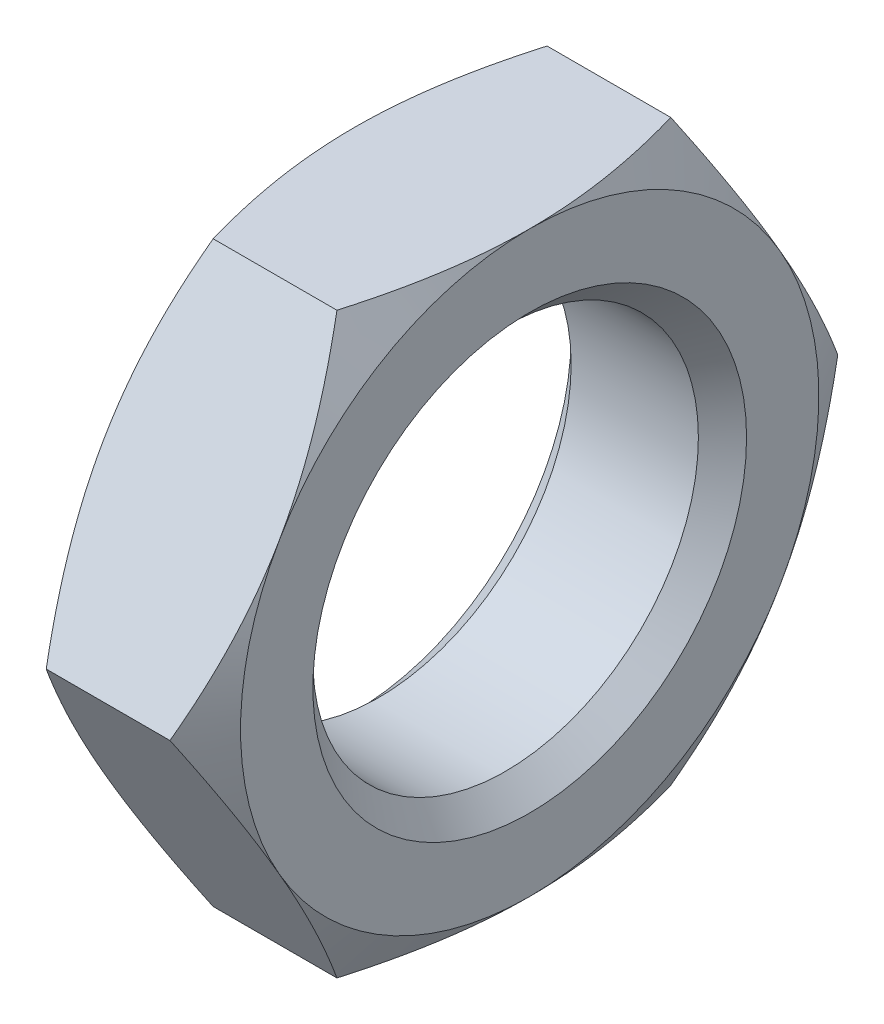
from build123d import *

# Parameters (mm, degrees)
SKETCH1_R      = 10
EXTRUDE1_DEPTH = 9.1
CHAMFER1_SIZE  = 1.25


with BuildPart() as part:
    # Sketch1 → Extrude1 (new body)
    with BuildSketch(Plane(origin=(0, 0, 0), x_dir=(0, 0, -1), z_dir=(1, 0, 0))):
        Polygon((8.660254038, 15), (-8.660254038, 15), (-17.320508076, 0), (-8.660254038, -15), (8.660254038, -15), (17.320508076, 0), align=None)
        Circle(SKETCH1_R, mode=Mode.SUBTRACT)
    extrude(amount=EXTRUDE1_DEPTH)

    # Sketch2 → Cut-Revolve1 (revolve, cut)
    with BuildSketch(Plane.XY):
        Polygon((9.1, 15), (9.1, 60), (0, 60), (0, 15), (4.55, 22.880831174), align=None)
    revolve(axis=Axis((9.1, 0, 0), (-1, 0, 0)), mode=Mode.SUBTRACT)

    # Chamfer1
    chamfer1_edges = [part.edges().sort_by_distance(p)[0] for p in [
        (0, 0, 10),
        (9.1, 0, 10),
    ]]
    chamfer(chamfer1_edges, length=CHAMFER1_SIZE)


solid = part.part
